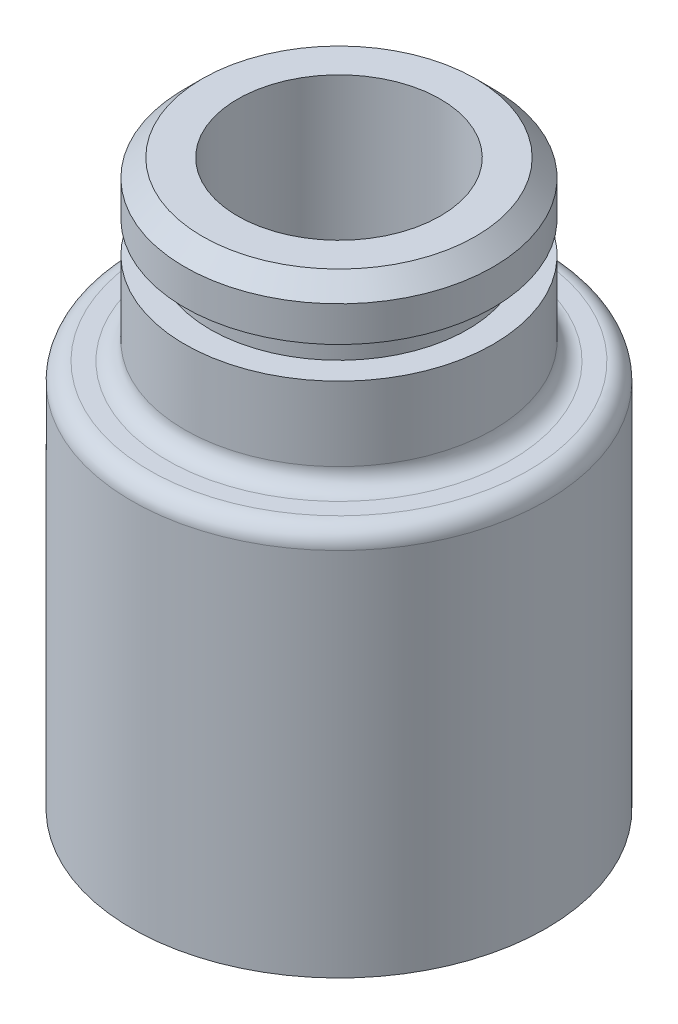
ISO-10303-21;
HEADER;
FILE_DESCRIPTION(('STEP AP214'),'2;1');
FILE_NAME('part.step','',(''),(''),'','','');
FILE_SCHEMA(('AUTOMOTIVE_DESIGN { 1 0 10303 214 1 1 1 1 }'));
ENDSEC;
DATA;
#1=APPLICATION_CONTEXT('core data for automotive mechanical design processes');
#2=APPLICATION_PROTOCOL_DEFINITION('international standard','automotive_design',2000,#1);
#3=PRODUCT_CONTEXT('',#1,'mechanical');
#4=PRODUCT('Part','Part','',(#3));
#5=PRODUCT_RELATED_PRODUCT_CATEGORY('part','',(#4));
#6=PRODUCT_DEFINITION_FORMATION('','',#4);
#7=PRODUCT_DEFINITION_CONTEXT('part definition',#1,'design');
#8=PRODUCT_DEFINITION('design','',#6,#7);
#9=PRODUCT_DEFINITION_SHAPE('','',#8);
#10=(LENGTH_UNIT() NAMED_UNIT(*) SI_UNIT(.MILLI.,.METRE.));
#11=(NAMED_UNIT(*) PLANE_ANGLE_UNIT() SI_UNIT($,.RADIAN.));
#12=(NAMED_UNIT(*) SI_UNIT($,.STERADIAN.) SOLID_ANGLE_UNIT());
#13=UNCERTAINTY_MEASURE_WITH_UNIT(LENGTH_MEASURE(1.E-05),#10,'distance_accuracy_value','');
#14=(GEOMETRIC_REPRESENTATION_CONTEXT(3) GLOBAL_UNCERTAINTY_ASSIGNED_CONTEXT((#13)) GLOBAL_UNIT_ASSIGNED_CONTEXT((#10,
#11,#12)) REPRESENTATION_CONTEXT('',''));
#15=CARTESIAN_POINT('',(0.,0.,0.));
#16=DIRECTION('',(0.,0.,1.));
#17=DIRECTION('',(1.,0.,0.));
#18=AXIS2_PLACEMENT_3D('',#15,#16,#17);
#19=CARTESIAN_POINT('',(1.90000029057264,27.2000002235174,0.));
#20=DIRECTION('',(0.,1.,0.));
#21=DIRECTION('',(1.,0.,0.));
#22=AXIS2_PLACEMENT_3D('',#19,#20,#21);
#23=PLANE('',#22);
#24=CARTESIAN_POINT('',(9.75,27.2000002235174,0.));
#25=DIRECTION('',(0.,1.,0.));
#26=DIRECTION('',(1.,0.,0.));
#27=AXIS2_PLACEMENT_3D('',#24,#25,#26);
#28=CIRCLE('',#27,8.74999970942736);
#29=CARTESIAN_POINT('',(18.4999997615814,27.2000002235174,0.));
#30=VERTEX_POINT('',#29);
#31=EDGE_CURVE('E163',#30,#30,#28,.T.);
#32=ORIENTED_EDGE('',*,*,#31,.T.);
#33=EDGE_LOOP('',(#32));
#34=FACE_BOUND('',#33,.T.);
#35=CARTESIAN_POINT('',(9.75,27.2000002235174,0.));
#36=DIRECTION('',(0.,1.,0.));
#37=DIRECTION('',(0.,0.,1.));
#38=AXIS2_PLACEMENT_3D('',#35,#36,#37);
#39=CIRCLE('',#38,7.2999998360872);
#40=CARTESIAN_POINT('',(9.75,27.2000002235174,7.2999998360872));
#41=VERTEX_POINT('',#40);
#42=EDGE_CURVE('E306',#41,#41,#39,.T.);
#43=ORIENTED_EDGE('',*,*,#42,.F.);
#44=EDGE_LOOP('',(#43));
#45=FACE_BOUND('',#44,.T.);
#46=ADVANCED_FACE('F48',(#34,#45),#23,.T.);
#47=CARTESIAN_POINT('',(9.75,25.1000002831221,0.));
#48=DIRECTION('',(0.,1.,0.));
#49=DIRECTION('',(-1.,0.,0.));
#50=AXIS2_PLACEMENT_3D('',#47,#48,#49);
#51=CYLINDRICAL_SURFACE('',#50,8.74999976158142);
#52=ORIENTED_EDGE('',*,*,#31,.F.);
#53=DIRECTION('',(0.,-1.,0.));
#54=VECTOR('',#53,1.);
#55=CARTESIAN_POINT('',(18.4999997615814,25.1000002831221,0.));
#56=LINE('',#55,#54);
#57=CARTESIAN_POINT('',(18.4999997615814,23.0000003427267,0.));
#58=VERTEX_POINT('',#57);
#59=EDGE_CURVE('E176',#30,#58,#56,.T.);
#60=ORIENTED_EDGE('',*,*,#59,.T.);
#61=CARTESIAN_POINT('',(9.75,23.0000003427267,0.));
#62=DIRECTION('',(0.,1.,0.));
#63=DIRECTION('',(1.,0.,0.));
#64=AXIS2_PLACEMENT_3D('',#61,#62,#63);
#65=CIRCLE('',#64,8.74999981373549);
#66=CARTESIAN_POINT('',(9.75,23.0000003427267,-8.74999981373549));
#67=VERTEX_POINT('',#66);
#68=EDGE_CURVE('E164',#58,#67,#65,.T.);
#69=ORIENTED_EDGE('',*,*,#68,.T.);
#70=CARTESIAN_POINT('',(9.75,23.0000003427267,0.));
#71=DIRECTION('',(0.,1.,0.));
#72=DIRECTION('',(1.,0.,0.));
#73=AXIS2_PLACEMENT_3D('',#70,#71,#72);
#74=CIRCLE('',#73,8.74999981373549);
#75=EDGE_CURVE('E160',#67,#58,#74,.T.);
#76=ORIENTED_EDGE('',*,*,#75,.T.);
#77=ORIENTED_EDGE('',*,*,#59,.F.);
#78=EDGE_LOOP('',(#52,#60,#69,#76,#77));
#79=FACE_BOUND('',#78,.T.);
#80=ADVANCED_FACE('F215',(#79),#51,.T.);
#81=CARTESIAN_POINT('',(9.75,23.0000003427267,0.));
#82=DIRECTION('',(0.,1.,0.));
#83=DIRECTION('',(0.,0.,1.));
#84=AXIS2_PLACEMENT_3D('',#81,#82,#83);
#85=TOROIDAL_SURFACE('',#84,9.75,1.00000011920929);
#86=CARTESIAN_POINT('',(9.75,22.0000002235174,0.));
#87=DIRECTION('',(0.,1.,0.));
#88=DIRECTION('',(1.,0.,0.));
#89=AXIS2_PLACEMENT_3D('',#86,#87,#88);
#90=CIRCLE('',#89,9.75);
#91=CARTESIAN_POINT('',(9.75,22.0000002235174,-9.75));
#92=VERTEX_POINT('',#91);
#93=EDGE_CURVE('E172',#92,#92,#90,.T.);
#94=ORIENTED_EDGE('',*,*,#93,.T.);
#95=CARTESIAN_POINT('',(9.75,23.0000003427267,-9.75));
#96=DIRECTION('',(-1.,0.,0.));
#97=DIRECTION('',(0.,0.,-1.));
#98=AXIS2_PLACEMENT_3D('',#95,#96,#97);
#99=CIRCLE('',#98,1.00000011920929);
#100=EDGE_CURVE('E169',#92,#67,#99,.T.);
#101=ORIENTED_EDGE('',*,*,#100,.T.);
#102=ORIENTED_EDGE('',*,*,#68,.F.);
#103=ORIENTED_EDGE('',*,*,#75,.F.);
#104=ORIENTED_EDGE('',*,*,#100,.F.);
#105=EDGE_LOOP('',(#94,#101,#102,#103,#104));
#106=FACE_BOUND('',#105,.T.);
#107=ADVANCED_FACE('F221',(#106),#85,.F.);
#108=CARTESIAN_POINT('',(0.,22.0000002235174,0.));
#109=DIRECTION('',(0.,1.,0.));
#110=DIRECTION('',(1.,0.,0.));
#111=AXIS2_PLACEMENT_3D('',#108,#109,#110);
#112=PLANE('',#111);
#113=ORIENTED_EDGE('',*,*,#93,.F.);
#114=EDGE_LOOP('',(#113));
#115=FACE_BOUND('',#114,.T.);
#116=CARTESIAN_POINT('',(9.75,22.0000002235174,0.));
#117=DIRECTION('',(0.,1.,0.));
#118=DIRECTION('',(1.,0.,0.));
#119=AXIS2_PLACEMENT_3D('',#116,#117,#118);
#120=CIRCLE('',#119,10.7500000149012);
#121=CARTESIAN_POINT('',(9.75,22.0000002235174,-10.7500000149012));
#122=VERTEX_POINT('',#121);
#123=EDGE_CURVE('E143',#122,#122,#120,.T.);
#124=ORIENTED_EDGE('',*,*,#123,.T.);
#125=EDGE_LOOP('',(#124));
#126=FACE_BOUND('',#125,.T.);
#127=ADVANCED_FACE('F251',(#115,#126),#112,.T.);
#128=CARTESIAN_POINT('',(9.75,21.0000003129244,0.));
#129=DIRECTION('',(0.,1.,0.));
#130=DIRECTION('',(0.,0.,1.));
#131=AXIS2_PLACEMENT_3D('',#128,#129,#130);
#132=TOROIDAL_SURFACE('',#131,10.7500000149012,0.999999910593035);
#133=ORIENTED_EDGE('',*,*,#123,.F.);
#134=CARTESIAN_POINT('',(9.75,21.0000003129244,-10.7500000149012));
#135=DIRECTION('',(-1.,0.,0.));
#136=DIRECTION('',(0.,0.,-1.));
#137=AXIS2_PLACEMENT_3D('',#134,#135,#136);
#138=CIRCLE('',#137,0.999999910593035);
#139=CARTESIAN_POINT('',(9.75,21.0000003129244,-11.7499999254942));
#140=VERTEX_POINT('',#139);
#141=EDGE_CURVE('E146',#122,#140,#138,.T.);
#142=ORIENTED_EDGE('',*,*,#141,.T.);
#143=CARTESIAN_POINT('',(9.75,21.0000003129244,0.));
#144=DIRECTION('',(0.,1.,0.));
#145=DIRECTION('',(1.,0.,0.));
#146=AXIS2_PLACEMENT_3D('',#143,#144,#145);
#147=CIRCLE('',#146,11.7499999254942);
#148=CARTESIAN_POINT('',(21.5,21.0000003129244,0.));
#149=VERTEX_POINT('',#148);
#150=EDGE_CURVE('E155',#140,#149,#147,.T.);
#151=ORIENTED_EDGE('',*,*,#150,.T.);
#152=CARTESIAN_POINT('',(9.75,21.0000003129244,0.));
#153=DIRECTION('',(0.,1.,0.));
#154=DIRECTION('',(1.,0.,0.));
#155=AXIS2_PLACEMENT_3D('',#152,#153,#154);
#156=CIRCLE('',#155,11.7499999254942);
#157=EDGE_CURVE('E158',#149,#140,#156,.T.);
#158=ORIENTED_EDGE('',*,*,#157,.T.);
#159=ORIENTED_EDGE('',*,*,#141,.F.);
#160=EDGE_LOOP('',(#133,#142,#151,#158,#159));
#161=FACE_BOUND('',#160,.T.);
#162=ADVANCED_FACE('F265',(#161),#132,.T.);
#163=CARTESIAN_POINT('',(9.75,10.5000001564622,0.));
#164=DIRECTION('',(0.,1.,0.));
#165=DIRECTION('',(-1.,0.,0.));
#166=AXIS2_PLACEMENT_3D('',#163,#164,#165);
#167=CYLINDRICAL_SURFACE('',#166,11.75);
#168=ORIENTED_EDGE('',*,*,#150,.F.);
#169=ORIENTED_EDGE('',*,*,#157,.F.);
#170=DIRECTION('',(0.,-1.,0.));
#171=VECTOR('',#170,1.);
#172=CARTESIAN_POINT('',(21.5,10.5000001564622,0.));
#173=LINE('',#172,#171);
#174=CARTESIAN_POINT('',(21.5,0.,0.));
#175=VERTEX_POINT('',#174);
#176=EDGE_CURVE('E147',#149,#175,#173,.T.);
#177=ORIENTED_EDGE('',*,*,#176,.T.);
#178=CARTESIAN_POINT('',(9.75,0.,0.));
#179=DIRECTION('',(0.,1.,0.));
#180=DIRECTION('',(1.,0.,0.));
#181=AXIS2_PLACEMENT_3D('',#178,#179,#180);
#182=CIRCLE('',#181,11.75);
#183=EDGE_CURVE('E159',#175,#175,#182,.T.);
#184=ORIENTED_EDGE('',*,*,#183,.T.);
#185=ORIENTED_EDGE('',*,*,#176,.F.);
#186=EDGE_LOOP('',(#168,#169,#177,#184,#185));
#187=FACE_BOUND('',#186,.T.);
#188=ADVANCED_FACE('F261',(#187),#167,.T.);
#189=CARTESIAN_POINT('',(-2.,0.,0.));
#190=DIRECTION('',(0.,-1.,0.));
#191=DIRECTION('',(0.,0.,-1.));
#192=AXIS2_PLACEMENT_3D('',#189,#190,#191);
#193=PLANE('',#192);
#194=CARTESIAN_POINT('',(9.75,0.,0.));
#195=DIRECTION('',(0.,1.,0.));
#196=DIRECTION('',(1.,0.,0.));
#197=AXIS2_PLACEMENT_3D('',#194,#195,#196);
#198=CIRCLE('',#197,9.75);
#199=CARTESIAN_POINT('',(19.5,0.,0.));
#200=VERTEX_POINT('',#199);
#201=EDGE_CURVE('E177',#200,#200,#198,.T.);
#202=ORIENTED_EDGE('',*,*,#201,.T.);
#203=EDGE_LOOP('',(#202));
#204=FACE_BOUND('',#203,.T.);
#205=ORIENTED_EDGE('',*,*,#183,.F.);
#206=EDGE_LOOP('',(#205));
#207=FACE_BOUND('',#206,.T.);
#208=ADVANCED_FACE('F257',(#204,#207),#193,.T.);
#209=CARTESIAN_POINT('',(9.75,7.50000011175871,0.));
#210=DIRECTION('',(0.,1.,0.));
#211=DIRECTION('',(-1.,0.,0.));
#212=AXIS2_PLACEMENT_3D('',#209,#210,#211);
#213=CYLINDRICAL_SURFACE('',#212,9.75);
#214=CARTESIAN_POINT('',(9.75,15.0000002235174,0.));
#215=DIRECTION('',(0.,1.,0.));
#216=DIRECTION('',(1.,0.,0.));
#217=AXIS2_PLACEMENT_3D('',#214,#215,#216);
#218=CIRCLE('',#217,9.75);
#219=CARTESIAN_POINT('',(19.5,15.0000002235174,0.));
#220=VERTEX_POINT('',#219);
#221=EDGE_CURVE('E193',#220,#220,#218,.T.);
#222=ORIENTED_EDGE('',*,*,#221,.T.);
#223=DIRECTION('',(0.,-1.,0.));
#224=VECTOR('',#223,1.);
#225=CARTESIAN_POINT('',(19.5,7.50000011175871,0.));
#226=LINE('',#225,#224);
#227=EDGE_CURVE('E179',#220,#200,#226,.T.);
#228=ORIENTED_EDGE('',*,*,#227,.T.);
#229=ORIENTED_EDGE('',*,*,#201,.F.);
#230=ORIENTED_EDGE('',*,*,#227,.F.);
#231=EDGE_LOOP('',(#222,#228,#229,#230));
#232=FACE_BOUND('',#231,.T.);
#233=ADVANCED_FACE('F260',(#232),#213,.F.);
#234=CARTESIAN_POINT('',(0.,15.0000002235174,0.));
#235=DIRECTION('',(0.,-1.,0.));
#236=DIRECTION('',(0.,0.,-1.));
#237=AXIS2_PLACEMENT_3D('',#234,#235,#236);
#238=PLANE('',#237);
#239=CARTESIAN_POINT('',(9.75,15.0000002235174,0.));
#240=DIRECTION('',(0.,1.,0.));
#241=DIRECTION('',(1.,0.,0.));
#242=AXIS2_PLACEMENT_3D('',#239,#240,#241);
#243=CIRCLE('',#242,6.75);
#244=CARTESIAN_POINT('',(16.5,15.0000002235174,0.));
#245=VERTEX_POINT('',#244);
#246=EDGE_CURVE('E196',#245,#245,#243,.T.);
#247=ORIENTED_EDGE('',*,*,#246,.T.);
#248=EDGE_LOOP('',(#247));
#249=FACE_BOUND('',#248,.T.);
#250=ORIENTED_EDGE('',*,*,#221,.F.);
#251=EDGE_LOOP('',(#250));
#252=FACE_BOUND('',#251,.T.);
#253=ADVANCED_FACE('F269',(#249,#252),#238,.T.);
#254=CARTESIAN_POINT('',(9.75,13.0000001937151,0.));
#255=DIRECTION('',(0.,1.,0.));
#256=DIRECTION('',(-1.,0.,0.));
#257=AXIS2_PLACEMENT_3D('',#254,#255,#256);
#258=CYLINDRICAL_SURFACE('',#257,6.75);
#259=ORIENTED_EDGE('',*,*,#246,.F.);
#260=DIRECTION('',(0.,-1.,0.));
#261=VECTOR('',#260,1.);
#262=CARTESIAN_POINT('',(16.5,13.0000001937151,0.));
#263=LINE('',#262,#261);
#264=CARTESIAN_POINT('',(16.5,11.0000001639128,0.));
#265=VERTEX_POINT('',#264);
#266=EDGE_CURVE('E199',#245,#265,#263,.T.);
#267=ORIENTED_EDGE('',*,*,#266,.T.);
#268=CARTESIAN_POINT('',(9.75,11.0000001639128,0.));
#269=DIRECTION('',(0.,1.,0.));
#270=DIRECTION('',(1.,0.,0.));
#271=AXIS2_PLACEMENT_3D('',#268,#269,#270);
#272=CIRCLE('',#271,6.75);
#273=EDGE_CURVE('E153',#265,#265,#272,.T.);
#274=ORIENTED_EDGE('',*,*,#273,.T.);
#275=ORIENTED_EDGE('',*,*,#266,.F.);
#276=EDGE_LOOP('',(#259,#267,#274,#275));
#277=FACE_BOUND('',#276,.T.);
#278=ADVANCED_FACE('F236',(#277),#258,.T.);
#279=CARTESIAN_POINT('',(3.,11.0000001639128,0.));
#280=DIRECTION('',(0.,1.,0.));
#281=DIRECTION('',(1.,0.,0.));
#282=AXIS2_PLACEMENT_3D('',#279,#280,#281);
#283=PLANE('',#282);
#284=ORIENTED_EDGE('',*,*,#273,.F.);
#285=EDGE_LOOP('',(#284));
#286=FACE_BOUND('',#285,.T.);
#287=CARTESIAN_POINT('',(9.75,11.0000001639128,0.));
#288=DIRECTION('',(0.,1.,0.));
#289=DIRECTION('',(1.,0.,0.));
#290=AXIS2_PLACEMENT_3D('',#287,#288,#289);
#291=CIRCLE('',#290,7.74999997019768);
#292=CARTESIAN_POINT('',(17.4999999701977,11.0000001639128,0.));
#293=VERTEX_POINT('',#292);
#294=EDGE_CURVE('E154',#293,#293,#291,.T.);
#295=ORIENTED_EDGE('',*,*,#294,.T.);
#296=EDGE_LOOP('',(#295));
#297=FACE_BOUND('',#296,.T.);
#298=ADVANCED_FACE('F232',(#286,#297),#283,.T.);
#299=CARTESIAN_POINT('',(9.75,9.00000013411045,0.));
#300=DIRECTION('',(0.,1.,0.));
#301=DIRECTION('',(-1.,0.,0.));
#302=AXIS2_PLACEMENT_3D('',#299,#300,#301);
#303=CONICAL_SURFACE('',#302,7.24999998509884,0.244978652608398);
#304=ORIENTED_EDGE('',*,*,#294,.F.);
#305=DIRECTION('',(-0.242535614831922,-0.970142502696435,0.));
#306=VECTOR('',#305,1.);
#307=CARTESIAN_POINT('',(16.9999999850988,9.00000013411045,0.));
#308=LINE('',#307,#306);
#309=CARTESIAN_POINT('',(16.5,7.00000010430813,0.));
#310=VERTEX_POINT('',#309);
#311=EDGE_CURVE('E151',#293,#310,#308,.T.);
#312=ORIENTED_EDGE('',*,*,#311,.T.);
#313=CARTESIAN_POINT('',(9.75,7.00000010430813,0.));
#314=DIRECTION('',(0.,1.,0.));
#315=DIRECTION('',(1.,0.,0.));
#316=AXIS2_PLACEMENT_3D('',#313,#314,#315);
#317=CIRCLE('',#316,6.75);
#318=EDGE_CURVE('E188',#310,#310,#317,.T.);
#319=ORIENTED_EDGE('',*,*,#318,.T.);
#320=ORIENTED_EDGE('',*,*,#311,.F.);
#321=EDGE_LOOP('',(#304,#312,#319,#320));
#322=FACE_BOUND('',#321,.T.);
#323=ADVANCED_FACE('F235',(#322),#303,.T.);
#324=CARTESIAN_POINT('',(9.75,5.50000008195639,0.));
#325=DIRECTION('',(0.,1.,0.));
#326=DIRECTION('',(-1.,0.,0.));
#327=AXIS2_PLACEMENT_3D('',#324,#325,#326);
#328=CYLINDRICAL_SURFACE('',#327,6.75);
#329=ORIENTED_EDGE('',*,*,#318,.F.);
#330=DIRECTION('',(0.,-1.,0.));
#331=VECTOR('',#330,1.);
#332=CARTESIAN_POINT('',(16.5,5.50000008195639,0.));
#333=LINE('',#332,#331);
#334=CARTESIAN_POINT('',(16.5,4.00000005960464,0.));
#335=VERTEX_POINT('',#334);
#336=EDGE_CURVE('E182',#310,#335,#333,.T.);
#337=ORIENTED_EDGE('',*,*,#336,.T.);
#338=CARTESIAN_POINT('',(9.75,4.00000005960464,0.));
#339=DIRECTION('',(0.,1.,0.));
#340=DIRECTION('',(1.,0.,0.));
#341=AXIS2_PLACEMENT_3D('',#338,#339,#340);
#342=CIRCLE('',#341,6.75);
#343=EDGE_CURVE('E149',#335,#335,#342,.T.);
#344=ORIENTED_EDGE('',*,*,#343,.T.);
#345=ORIENTED_EDGE('',*,*,#336,.F.);
#346=EDGE_LOOP('',(#329,#337,#344,#345));
#347=FACE_BOUND('',#346,.T.);
#348=ADVANCED_FACE('F245',(#347),#328,.T.);
#349=CARTESIAN_POINT('',(3.,4.00000005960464,0.));
#350=DIRECTION('',(0.,1.,0.));
#351=DIRECTION('',(1.,0.,0.));
#352=AXIS2_PLACEMENT_3D('',#349,#350,#351);
#353=PLANE('',#352);
#354=ORIENTED_EDGE('',*,*,#343,.F.);
#355=EDGE_LOOP('',(#354));
#356=FACE_BOUND('',#355,.T.);
#357=CARTESIAN_POINT('',(9.75,4.00000005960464,0.));
#358=DIRECTION('',(0.,1.,0.));
#359=DIRECTION('',(1.,0.,0.));
#360=AXIS2_PLACEMENT_3D('',#357,#358,#359);
#361=CIRCLE('',#360,7.74999997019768);
#362=CARTESIAN_POINT('',(17.4999999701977,4.00000005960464,0.));
#363=VERTEX_POINT('',#362);
#364=EDGE_CURVE('E141',#363,#363,#361,.T.);
#365=ORIENTED_EDGE('',*,*,#364,.T.);
#366=EDGE_LOOP('',(#365));
#367=FACE_BOUND('',#366,.T.);
#368=ADVANCED_FACE('F248',(#356,#367),#353,.T.);
#369=CARTESIAN_POINT('',(9.75,2.00000002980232,0.));
#370=DIRECTION('',(0.,1.,0.));
#371=DIRECTION('',(-1.,0.,0.));
#372=AXIS2_PLACEMENT_3D('',#369,#370,#371);
#373=CONICAL_SURFACE('',#372,7.24999998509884,0.244978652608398);
#374=ORIENTED_EDGE('',*,*,#364,.F.);
#375=DIRECTION('',(-0.242535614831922,-0.970142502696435,0.));
#376=VECTOR('',#375,1.);
#377=CARTESIAN_POINT('',(16.9999999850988,2.00000002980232,0.));
#378=LINE('',#377,#376);
#379=CARTESIAN_POINT('',(16.5,0.,0.));
#380=VERTEX_POINT('',#379);
#381=EDGE_CURVE('E148',#363,#380,#378,.T.);
#382=ORIENTED_EDGE('',*,*,#381,.T.);
#383=CARTESIAN_POINT('',(9.75,0.,0.));
#384=DIRECTION('',(0.,1.,0.));
#385=DIRECTION('',(1.,0.,0.));
#386=AXIS2_PLACEMENT_3D('',#383,#384,#385);
#387=CIRCLE('',#386,6.75);
#388=EDGE_CURVE('E135',#380,#380,#387,.T.);
#389=ORIENTED_EDGE('',*,*,#388,.T.);
#390=ORIENTED_EDGE('',*,*,#381,.F.);
#391=EDGE_LOOP('',(#374,#382,#389,#390));
#392=FACE_BOUND('',#391,.T.);
#393=ADVANCED_FACE('F227',(#392),#373,.T.);
#394=CARTESIAN_POINT('',(3.,0.,0.));
#395=DIRECTION('',(0.,-1.,0.));
#396=DIRECTION('',(0.,0.,-1.));
#397=AXIS2_PLACEMENT_3D('',#394,#395,#396);
#398=PLANE('',#397);
#399=CARTESIAN_POINT('',(9.75,0.,0.));
#400=DIRECTION('',(0.,1.,0.));
#401=DIRECTION('',(1.,0.,0.));
#402=AXIS2_PLACEMENT_3D('',#399,#400,#401);
#403=CIRCLE('',#402,5.74999994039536);
#404=CARTESIAN_POINT('',(15.4999999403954,0.,0.));
#405=VERTEX_POINT('',#404);
#406=EDGE_CURVE('E133',#405,#405,#403,.T.);
#407=ORIENTED_EDGE('',*,*,#406,.T.);
#408=EDGE_LOOP('',(#407));
#409=FACE_BOUND('',#408,.T.);
#410=ORIENTED_EDGE('',*,*,#388,.F.);
#411=EDGE_LOOP('',(#410));
#412=FACE_BOUND('',#411,.T.);
#413=ADVANCED_FACE('F231',(#409,#412),#398,.T.);
#414=CARTESIAN_POINT('',(9.75,7.64510865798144,0.));
#415=DIRECTION('',(0.,1.,0.));
#416=DIRECTION('',(-1.,0.,0.));
#417=AXIS2_PLACEMENT_3D('',#414,#415,#416);
#418=CYLINDRICAL_SURFACE('',#417,5.74999994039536);
#419=CARTESIAN_POINT('',(9.75,32.0000004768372,0.));
#420=DIRECTION('',(0.,1.,0.));
#421=DIRECTION('',(1.,0.,0.));
#422=AXIS2_PLACEMENT_3D('',#419,#420,#421);
#423=CIRCLE('',#422,5.7499999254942);
#424=CARTESIAN_POINT('',(15.4999999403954,32.0000004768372,0.));
#425=VERTEX_POINT('',#424);
#426=EDGE_CURVE('E132',#425,#425,#423,.T.);
#427=ORIENTED_EDGE('',*,*,#426,.T.);
#428=DIRECTION('',(0.,-1.,0.));
#429=VECTOR('',#428,1.);
#430=CARTESIAN_POINT('',(15.4999999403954,7.64510865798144,0.));
#431=LINE('',#430,#429);
#432=EDGE_CURVE('E129',#425,#405,#431,.T.);
#433=ORIENTED_EDGE('',*,*,#432,.T.);
#434=ORIENTED_EDGE('',*,*,#406,.F.);
#435=ORIENTED_EDGE('',*,*,#432,.F.);
#436=EDGE_LOOP('',(#427,#433,#434,#435));
#437=FACE_BOUND('',#436,.T.);
#438=ADVANCED_FACE('F130',(#437),#418,.F.);
#439=CARTESIAN_POINT('',(4.00000007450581,32.0000004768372,0.));
#440=DIRECTION('',(0.,1.,0.));
#441=DIRECTION('',(1.,0.,0.));
#442=AXIS2_PLACEMENT_3D('',#439,#440,#441);
#443=PLANE('',#442);
#444=CARTESIAN_POINT('',(9.75,32.0000004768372,0.));
#445=DIRECTION('',(0.,1.,0.));
#446=DIRECTION('',(0.,0.,1.));
#447=AXIS2_PLACEMENT_3D('',#444,#445,#446);
#448=CIRCLE('',#447,7.74999970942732);
#449=CARTESIAN_POINT('',(17.4999997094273,32.0000004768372,0.));
#450=VERTEX_POINT('',#449);
#451=EDGE_CURVE('E58',#450,#450,#448,.T.);
#452=ORIENTED_EDGE('',*,*,#451,.T.);
#453=EDGE_LOOP('',(#452));
#454=FACE_BOUND('',#453,.T.);
#455=ORIENTED_EDGE('',*,*,#426,.F.);
#456=EDGE_LOOP('',(#455));
#457=FACE_BOUND('',#456,.T.);
#458=ADVANCED_FACE('F204',(#454,#457),#443,.T.);
#459=CARTESIAN_POINT('',(9.75,30.5000002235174,0.));
#460=DIRECTION('',(0.,1.,0.));
#461=DIRECTION('',(-1.,0.,0.));
#462=AXIS2_PLACEMENT_3D('',#459,#460,#461);
#463=CYLINDRICAL_SURFACE('',#462,8.74999983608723);
#464=DIRECTION('',(0.,-1.,0.));
#465=VECTOR('',#464,1.);
#466=CARTESIAN_POINT('',(18.4999998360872,30.5000002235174,0.));
#467=LINE('',#466,#465);
#468=CARTESIAN_POINT('',(18.4999998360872,31.0000003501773,0.));
#469=VERTEX_POINT('',#468);
#470=CARTESIAN_POINT('',(18.4999998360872,29.0000002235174,0.));
#471=VERTEX_POINT('',#470);
#472=EDGE_CURVE('E137',#469,#471,#467,.T.);
#473=ORIENTED_EDGE('',*,*,#472,.F.);
#474=CARTESIAN_POINT('',(9.75,31.0000003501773,0.));
#475=DIRECTION('',(0.,1.,0.));
#476=DIRECTION('',(0.,0.,1.));
#477=AXIS2_PLACEMENT_3D('',#474,#475,#476);
#478=CIRCLE('',#477,8.74999983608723);
#479=EDGE_CURVE('E11',#469,#469,#478,.F.);
#480=ORIENTED_EDGE('',*,*,#479,.T.);
#481=ORIENTED_EDGE('',*,*,#472,.T.);
#482=CARTESIAN_POINT('',(9.75,29.0000002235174,0.));
#483=DIRECTION('',(0.,1.,0.));
#484=DIRECTION('',(1.,0.,0.));
#485=AXIS2_PLACEMENT_3D('',#482,#483,#484);
#486=CIRCLE('',#485,8.74999970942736);
#487=EDGE_CURVE('E165',#471,#471,#486,.T.);
#488=ORIENTED_EDGE('',*,*,#487,.T.);
#489=EDGE_LOOP('',(#473,#480,#481,#488));
#490=FACE_BOUND('',#489,.T.);
#491=ADVANCED_FACE('F240',(#490),#463,.T.);
#492=CARTESIAN_POINT('',(1.00000029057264,29.0000002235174,0.));
#493=DIRECTION('',(0.,-1.,0.));
#494=DIRECTION('',(0.,0.,-1.));
#495=AXIS2_PLACEMENT_3D('',#492,#493,#494);
#496=PLANE('',#495);
#497=ORIENTED_EDGE('',*,*,#487,.F.);
#498=EDGE_LOOP('',(#497));
#499=FACE_BOUND('',#498,.T.);
#500=CARTESIAN_POINT('',(9.75,29.0000002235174,0.));
#501=DIRECTION('',(0.,-1.,0.));
#502=DIRECTION('',(0.,0.,-1.));
#503=AXIS2_PLACEMENT_3D('',#500,#501,#502);
#504=CIRCLE('',#503,7.2999998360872);
#505=CARTESIAN_POINT('',(9.75,29.0000002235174,-7.2999998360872));
#506=VERTEX_POINT('',#505);
#507=EDGE_CURVE('E168',#506,#506,#504,.T.);
#508=ORIENTED_EDGE('',*,*,#507,.F.);
#509=EDGE_LOOP('',(#508));
#510=FACE_BOUND('',#509,.T.);
#511=ADVANCED_FACE('F211',(#499,#510),#496,.T.);
#512=CARTESIAN_POINT('',(9.75,51.2031523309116,0.));
#513=DIRECTION('',(0.,-1.,0.));
#514=DIRECTION('',(0.,0.,-1.));
#515=AXIS2_PLACEMENT_3D('',#512,#513,#514);
#516=CYLINDRICAL_SURFACE('',#515,7.2999998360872);
#517=ORIENTED_EDGE('',*,*,#507,.T.);
#518=EDGE_LOOP('',(#517));
#519=FACE_BOUND('',#518,.T.);
#520=ORIENTED_EDGE('',*,*,#42,.T.);
#521=EDGE_LOOP('',(#520));
#522=FACE_BOUND('',#521,.T.);
#523=ADVANCED_FACE('F207',(#519,#522),#516,.T.);
#524=CARTESIAN_POINT('',(9.75,32.0000004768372,0.));
#525=DIRECTION('',(0.,-1.,0.));
#526=DIRECTION('',(0.,0.,-1.));
#527=AXIS2_PLACEMENT_3D('',#524,#525,#526);
#528=CONICAL_SURFACE('',#527,7.74999970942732,0.785398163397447);
#529=DIRECTION('',(-0.707106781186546,0.707106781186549,0.));
#530=VECTOR('',#529,1.);
#531=CARTESIAN_POINT('',(18.4999998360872,31.0000003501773,0.));
#532=LINE('',#531,#530);
#533=EDGE_CURVE('E53',#469,#450,#532,.T.);
#534=ORIENTED_EDGE('',*,*,#533,.F.);
#535=ORIENTED_EDGE('',*,*,#479,.F.);
#536=ORIENTED_EDGE('',*,*,#533,.T.);
#537=ORIENTED_EDGE('',*,*,#451,.F.);
#538=EDGE_LOOP('',(#534,#535,#536,#537));
#539=FACE_BOUND('',#538,.T.);
#540=ADVANCED_FACE('F51',(#539),#528,.T.);
#541=CLOSED_SHELL('',(#46,#80,#107,#127,#162,#188,#208,#233,#253,#278,#298,#323,#348,#368,#393,
#413,#438,#458,#491,#511,#523,#540));
#542=MANIFOLD_SOLID_BREP('B2',#541);
#543=ADVANCED_BREP_SHAPE_REPRESENTATION('',(#18,#542),#14);
#544=SHAPE_DEFINITION_REPRESENTATION(#9,#543);
ENDSEC;
END-ISO-10303-21;
